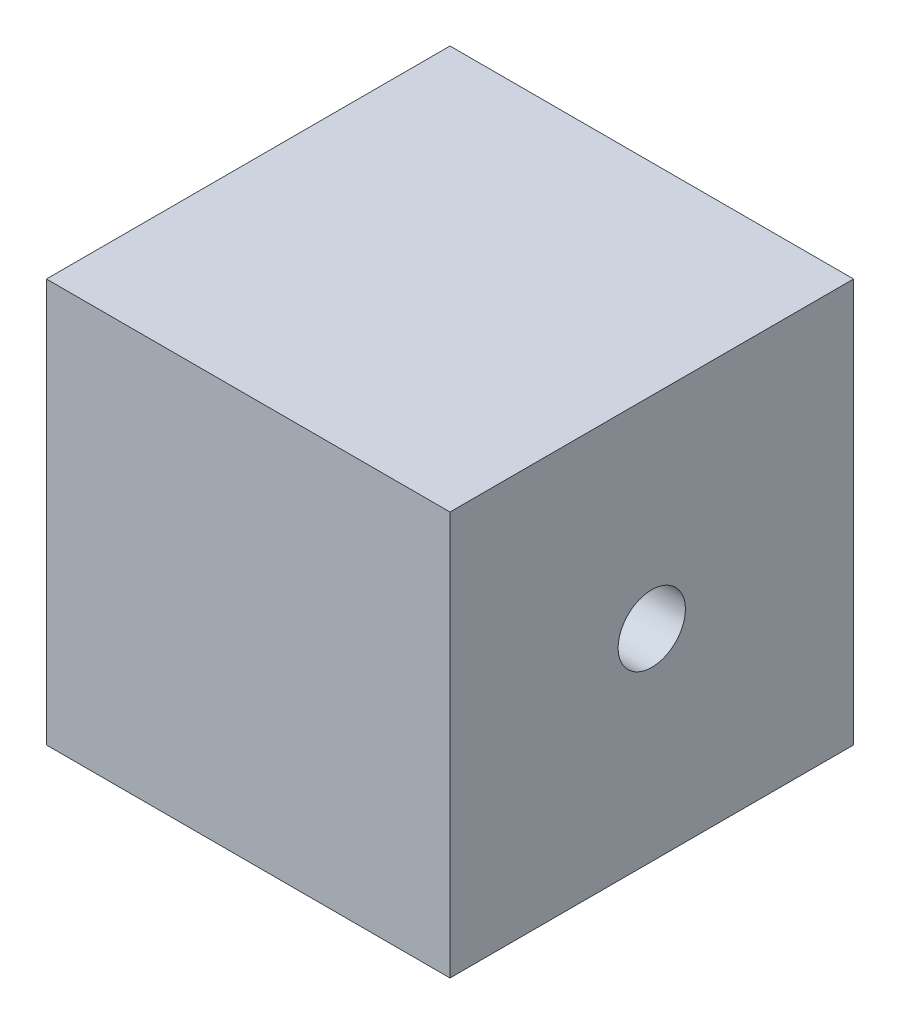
from build123d import *

# Parameters (mm, degrees)
SKETCH1_W           = 152.4
SKETCH1_H           = 152.4
BOSS_EXTRUDE1_DEPTH = 76.2
SKETCH2_R           = 12.7
CUT_EXTRUDE1_DEPTH  = 76.2


with BuildPart() as part:
    # Sketch1 → Boss-Extrude1 (new, symmetric)
    with BuildSketch(Plane.XY):
        Rectangle(SKETCH1_W, SKETCH1_H)
    extrude(amount=BOSS_EXTRUDE1_DEPTH, both=True)

    # Sketch2 → Cut-Extrude1 (cut)
    with BuildSketch(Plane(origin=(76.2, 0, 0), x_dir=(0, 0, -1), z_dir=(1, 0, 0))):
        Circle(SKETCH2_R)
    extrude(amount=-CUT_EXTRUDE1_DEPTH, mode=Mode.SUBTRACT)


solid = part.part
